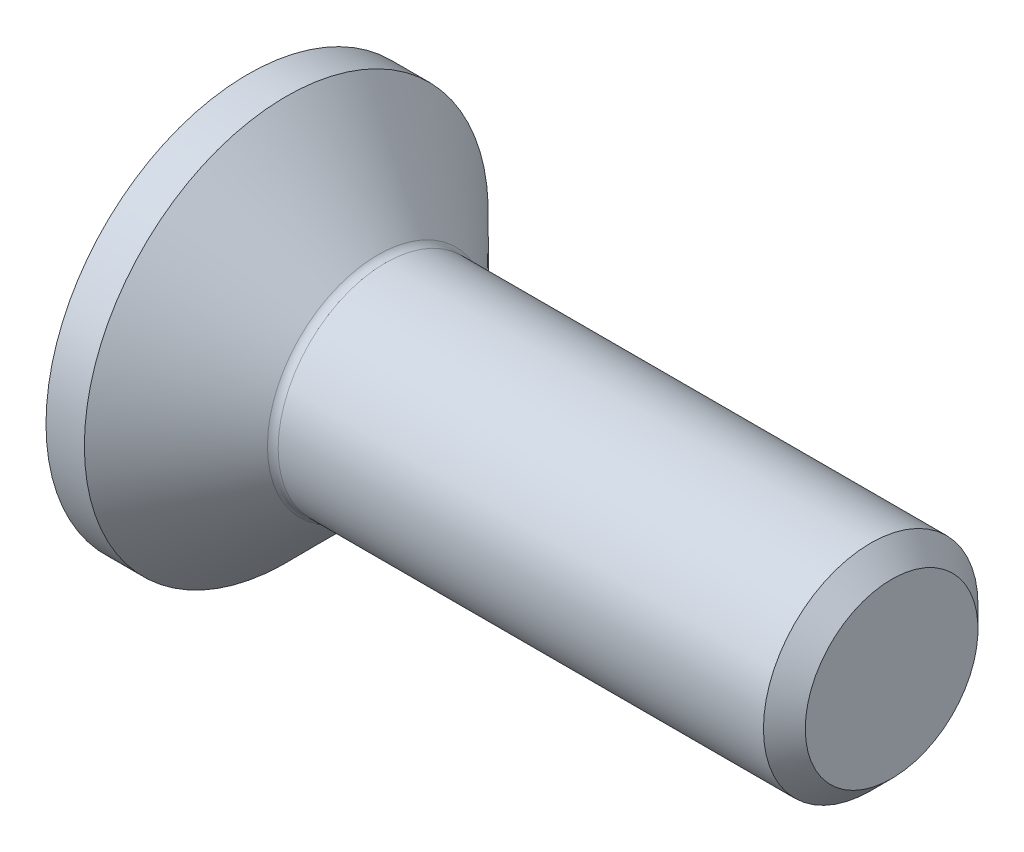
ISO-10303-21;
HEADER;
FILE_DESCRIPTION(('STEP AP214'),'2;1');
FILE_NAME('part.step','',(''),(''),'','','');
FILE_SCHEMA(('AUTOMOTIVE_DESIGN { 1 0 10303 214 1 1 1 1 }'));
ENDSEC;
DATA;
#1=APPLICATION_CONTEXT('core data for automotive mechanical design processes');
#2=APPLICATION_PROTOCOL_DEFINITION('international standard','automotive_design',2000,#1);
#3=PRODUCT_CONTEXT('',#1,'mechanical');
#4=PRODUCT('Part','Part','',(#3));
#5=PRODUCT_RELATED_PRODUCT_CATEGORY('part','',(#4));
#6=PRODUCT_DEFINITION_FORMATION('','',#4);
#7=PRODUCT_DEFINITION_CONTEXT('part definition',#1,'design');
#8=PRODUCT_DEFINITION('design','',#6,#7);
#9=PRODUCT_DEFINITION_SHAPE('','',#8);
#10=(LENGTH_UNIT() NAMED_UNIT(*) SI_UNIT(.MILLI.,.METRE.));
#11=(NAMED_UNIT(*) PLANE_ANGLE_UNIT() SI_UNIT($,.RADIAN.));
#12=(NAMED_UNIT(*) SI_UNIT($,.STERADIAN.) SOLID_ANGLE_UNIT());
#13=UNCERTAINTY_MEASURE_WITH_UNIT(LENGTH_MEASURE(1.E-05),#10,'distance_accuracy_value','');
#14=(GEOMETRIC_REPRESENTATION_CONTEXT(3) GLOBAL_UNCERTAINTY_ASSIGNED_CONTEXT((#13)) GLOBAL_UNIT_ASSIGNED_CONTEXT((#10,
#11,#12)) REPRESENTATION_CONTEXT('',''));
#15=CARTESIAN_POINT('',(0.,0.,0.));
#16=DIRECTION('',(0.,0.,1.));
#17=DIRECTION('',(1.,0.,0.));
#18=AXIS2_PLACEMENT_3D('',#15,#16,#17);
#19=CARTESIAN_POINT('',(0.,0.,0.));
#20=DIRECTION('',(-1.,0.,0.));
#21=DIRECTION('',(0.,0.,1.));
#22=AXIS2_PLACEMENT_3D('',#19,#20,#21);
#23=PLANE('',#22);
#24=CARTESIAN_POINT('',(0.,0.,0.));
#25=DIRECTION('',(-1.,0.,0.));
#26=DIRECTION('',(0.,0.,1.));
#27=AXIS2_PLACEMENT_3D('',#24,#25,#26);
#28=CIRCLE('',#27,3.765);
#29=CARTESIAN_POINT('',(0.,0.,3.765));
#30=VERTEX_POINT('',#29);
#31=EDGE_CURVE('E158',#30,#30,#28,.T.);
#32=ORIENTED_EDGE('',*,*,#31,.T.);
#33=EDGE_LOOP('',(#32));
#34=FACE_BOUND('',#33,.T.);
#35=DIRECTION('',(0.,-0.500000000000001,-0.866025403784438));
#36=VECTOR('',#35,1.);
#37=CARTESIAN_POINT('',(0.,-0.727461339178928,1.26));
#38=LINE('',#37,#36);
#39=CARTESIAN_POINT('',(0.,-0.727461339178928,1.26));
#40=VERTEX_POINT('',#39);
#41=CARTESIAN_POINT('',(0.,-1.45492267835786,0.));
#42=VERTEX_POINT('',#41);
#43=EDGE_CURVE('E120',#40,#42,#38,.T.);
#44=ORIENTED_EDGE('',*,*,#43,.T.);
#45=DIRECTION('',(0.,0.5,-0.866025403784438));
#46=VECTOR('',#45,1.);
#47=CARTESIAN_POINT('',(0.,-1.45492267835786,0.));
#48=LINE('',#47,#46);
#49=CARTESIAN_POINT('',(0.,-0.727461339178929,-1.26));
#50=VERTEX_POINT('',#49);
#51=EDGE_CURVE('E50',#42,#50,#48,.T.);
#52=ORIENTED_EDGE('',*,*,#51,.T.);
#53=DIRECTION('',(0.,1.,0.));
#54=VECTOR('',#53,1.);
#55=CARTESIAN_POINT('',(0.,-0.727461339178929,-1.26));
#56=LINE('',#55,#54);
#57=CARTESIAN_POINT('',(0.,0.727461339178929,-1.26));
#58=VERTEX_POINT('',#57);
#59=EDGE_CURVE('E135',#50,#58,#56,.T.);
#60=ORIENTED_EDGE('',*,*,#59,.T.);
#61=DIRECTION('',(0.,0.5,0.866025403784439));
#62=VECTOR('',#61,1.);
#63=CARTESIAN_POINT('',(0.,0.727461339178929,-1.26));
#64=LINE('',#63,#62);
#65=CARTESIAN_POINT('',(0.,1.45492267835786,0.));
#66=VERTEX_POINT('',#65);
#67=EDGE_CURVE('E271',#58,#66,#64,.T.);
#68=ORIENTED_EDGE('',*,*,#67,.T.);
#69=DIRECTION('',(0.,-0.5,0.866025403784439));
#70=VECTOR('',#69,1.);
#71=CARTESIAN_POINT('',(0.,1.45492267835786,0.));
#72=LINE('',#71,#70);
#73=CARTESIAN_POINT('',(0.,0.727461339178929,1.26));
#74=VERTEX_POINT('',#73);
#75=EDGE_CURVE('E274',#66,#74,#72,.T.);
#76=ORIENTED_EDGE('',*,*,#75,.T.);
#77=DIRECTION('',(0.,-1.,0.));
#78=VECTOR('',#77,1.);
#79=CARTESIAN_POINT('',(0.,0.727461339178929,1.26));
#80=LINE('',#79,#78);
#81=EDGE_CURVE('E277',#74,#40,#80,.T.);
#82=ORIENTED_EDGE('',*,*,#81,.T.);
#83=EDGE_LOOP('',(#44,#52,#60,#68,#76,#82));
#84=FACE_BOUND('',#83,.T.);
#85=ADVANCED_FACE('F35',(#34,#84),#23,.T.);
#86=CARTESIAN_POINT('',(0.,0.,0.));
#87=DIRECTION('',(-1.,0.,0.));
#88=DIRECTION('',(0.,0.,1.));
#89=AXIS2_PLACEMENT_3D('',#86,#87,#88);
#90=CYLINDRICAL_SURFACE('',#89,3.765);
#91=CARTESIAN_POINT('',(0.71500000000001,0.,0.));
#92=DIRECTION('',(-1.,0.,0.));
#93=DIRECTION('',(0.,0.,1.));
#94=AXIS2_PLACEMENT_3D('',#91,#92,#93);
#95=CIRCLE('',#94,3.765);
#96=CARTESIAN_POINT('',(0.71500000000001,0.,3.765));
#97=VERTEX_POINT('',#96);
#98=EDGE_CURVE('E155',#97,#97,#95,.T.);
#99=ORIENTED_EDGE('',*,*,#98,.T.);
#100=EDGE_LOOP('',(#99));
#101=FACE_BOUND('',#100,.T.);
#102=ORIENTED_EDGE('',*,*,#31,.F.);
#103=EDGE_LOOP('',(#102));
#104=FACE_BOUND('',#103,.T.);
#105=ADVANCED_FACE('F179',(#101,#104),#90,.T.);
#106=CARTESIAN_POINT('',(0.71500000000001,0.,0.));
#107=DIRECTION('',(-1.,0.,0.));
#108=DIRECTION('',(0.,0.,1.));
#109=AXIS2_PLACEMENT_3D('',#106,#107,#108);
#110=CONICAL_SURFACE('',#109,3.765,0.785398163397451);
#111=CARTESIAN_POINT('',(2.42142135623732,0.,0.));
#112=DIRECTION('',(-1.,0.,0.));
#113=DIRECTION('',(0.,0.,1.));
#114=AXIS2_PLACEMENT_3D('',#111,#112,#113);
#115=CIRCLE('',#114,2.05857864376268);
#116=CARTESIAN_POINT('',(2.42142135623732,0.,2.05857864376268));
#117=VERTEX_POINT('',#116);
#118=EDGE_CURVE('E43',#117,#117,#115,.T.);
#119=ORIENTED_EDGE('',*,*,#118,.T.);
#120=EDGE_LOOP('',(#119));
#121=FACE_BOUND('',#120,.T.);
#122=ORIENTED_EDGE('',*,*,#98,.F.);
#123=EDGE_LOOP('',(#122));
#124=FACE_BOUND('',#123,.T.);
#125=ADVANCED_FACE('F163',(#121,#124),#110,.T.);
#126=CARTESIAN_POINT('',(0.,0.,0.));
#127=DIRECTION('',(-1.,0.,0.));
#128=DIRECTION('',(0.,0.,1.));
#129=AXIS2_PLACEMENT_3D('',#126,#127,#128);
#130=CYLINDRICAL_SURFACE('',#129,1.99999999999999);
#131=CARTESIAN_POINT('',(2.56284271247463,0.,0.));
#132=DIRECTION('',(-1.,0.,0.));
#133=DIRECTION('',(0.,0.,1.));
#134=AXIS2_PLACEMENT_3D('',#131,#132,#133);
#135=CIRCLE('',#134,1.99999999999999);
#136=CARTESIAN_POINT('',(2.56284271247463,0.,1.99999999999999));
#137=VERTEX_POINT('',#136);
#138=EDGE_CURVE('E11',#137,#137,#135,.F.);
#139=ORIENTED_EDGE('',*,*,#138,.T.);
#140=EDGE_LOOP('',(#139));
#141=FACE_BOUND('',#140,.T.);
#142=CARTESIAN_POINT('',(11.61,0.,0.));
#143=DIRECTION('',(-1.,0.,0.));
#144=DIRECTION('',(0.,0.,1.));
#145=AXIS2_PLACEMENT_3D('',#142,#143,#144);
#146=CIRCLE('',#145,1.99999999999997);
#147=CARTESIAN_POINT('',(11.61,0.,1.99999999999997));
#148=VERTEX_POINT('',#147);
#149=EDGE_CURVE('E152',#148,#148,#146,.T.);
#150=ORIENTED_EDGE('',*,*,#149,.T.);
#151=EDGE_LOOP('',(#150));
#152=FACE_BOUND('',#151,.T.);
#153=ADVANCED_FACE('F190',(#141,#152),#130,.T.);
#154=CARTESIAN_POINT('',(12.,0.,0.));
#155=DIRECTION('',(-1.,0.,0.));
#156=DIRECTION('',(0.,0.,1.));
#157=AXIS2_PLACEMENT_3D('',#154,#155,#156);
#158=CONICAL_SURFACE('',#157,1.61,0.785398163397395);
#159=ORIENTED_EDGE('',*,*,#149,.F.);
#160=EDGE_LOOP('',(#159));
#161=FACE_BOUND('',#160,.T.);
#162=CARTESIAN_POINT('',(12.,0.,0.));
#163=DIRECTION('',(-1.,0.,0.));
#164=DIRECTION('',(0.,0.,1.));
#165=AXIS2_PLACEMENT_3D('',#162,#163,#164);
#166=CIRCLE('',#165,1.61);
#167=CARTESIAN_POINT('',(12.,0.,1.61));
#168=VERTEX_POINT('',#167);
#169=EDGE_CURVE('E148',#168,#168,#166,.T.);
#170=ORIENTED_EDGE('',*,*,#169,.T.);
#171=EDGE_LOOP('',(#170));
#172=FACE_BOUND('',#171,.T.);
#173=ADVANCED_FACE('F174',(#161,#172),#158,.T.);
#174=CARTESIAN_POINT('',(12.,1.61,0.));
#175=DIRECTION('',(1.,0.,0.));
#176=DIRECTION('',(0.,0.,-1.));
#177=AXIS2_PLACEMENT_3D('',#174,#175,#176);
#178=PLANE('',#177);
#179=ORIENTED_EDGE('',*,*,#169,.F.);
#180=EDGE_LOOP('',(#179));
#181=FACE_BOUND('',#180,.T.);
#182=ADVANCED_FACE('F167',(#181),#178,.T.);
#183=CARTESIAN_POINT('',(2.56284271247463,0.,0.));
#184=DIRECTION('',(-1.,0.,0.));
#185=DIRECTION('',(0.,0.,1.));
#186=AXIS2_PLACEMENT_3D('',#183,#184,#185);
#187=TOROIDAL_SURFACE('',#186,2.19999999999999,0.2);
#188=ORIENTED_EDGE('',*,*,#138,.F.);
#189=EDGE_LOOP('',(#188));
#190=FACE_BOUND('',#189,.T.);
#191=ORIENTED_EDGE('',*,*,#118,.F.);
#192=EDGE_LOOP('',(#191));
#193=FACE_BOUND('',#192,.T.);
#194=ADVANCED_FACE('F37',(#190,#193),#187,.F.);
#195=CARTESIAN_POINT('',(1.5,-1.45492267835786,0.));
#196=DIRECTION('',(0.,0.866025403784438,0.5));
#197=DIRECTION('',(0.,-0.5,0.866025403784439));
#198=AXIS2_PLACEMENT_3D('',#195,#196,#197);
#199=PLANE('',#198);
#200=ORIENTED_EDGE('',*,*,#51,.F.);
#201=DIRECTION('',(-1.,0.,0.));
#202=VECTOR('',#201,1.);
#203=CARTESIAN_POINT('',(1.5,-1.45492267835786,0.));
#204=LINE('',#203,#202);
#205=CARTESIAN_POINT('',(1.5,-1.45492267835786,0.));
#206=VERTEX_POINT('',#205);
#207=EDGE_CURVE('E268',#206,#42,#204,.T.);
#208=ORIENTED_EDGE('',*,*,#207,.F.);
#209=DIRECTION('',(0.,0.5,-0.866025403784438));
#210=VECTOR('',#209,1.);
#211=CARTESIAN_POINT('',(1.5,-1.45492267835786,0.));
#212=LINE('',#211,#210);
#213=CARTESIAN_POINT('',(1.5,-1.09119200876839,-0.630000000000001));
#214=VERTEX_POINT('',#213);
#215=EDGE_CURVE('E117',#206,#214,#212,.T.);
#216=ORIENTED_EDGE('',*,*,#215,.T.);
#217=CARTESIAN_POINT('',(1.5,-0.727461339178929,-1.26));
#218=VERTEX_POINT('',#217);
#219=EDGE_CURVE('E111',#214,#218,#212,.T.);
#220=ORIENTED_EDGE('',*,*,#219,.T.);
#221=DIRECTION('',(-1.,0.,0.));
#222=VECTOR('',#221,1.);
#223=CARTESIAN_POINT('',(1.5,-0.727461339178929,-1.26));
#224=LINE('',#223,#222);
#225=EDGE_CURVE('E115',#218,#50,#224,.T.);
#226=ORIENTED_EDGE('',*,*,#225,.T.);
#227=EDGE_LOOP('',(#200,#208,#216,#220,#226));
#228=FACE_BOUND('',#227,.T.);
#229=ADVANCED_FACE('F113',(#228),#199,.T.);
#230=CARTESIAN_POINT('',(1.5,-0.727461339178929,-1.26));
#231=DIRECTION('',(0.,0.,1.));
#232=DIRECTION('',(0.,-1.,0.));
#233=AXIS2_PLACEMENT_3D('',#230,#231,#232);
#234=PLANE('',#233);
#235=ORIENTED_EDGE('',*,*,#59,.F.);
#236=ORIENTED_EDGE('',*,*,#225,.F.);
#237=DIRECTION('',(0.,1.,0.));
#238=VECTOR('',#237,1.);
#239=CARTESIAN_POINT('',(1.5,-0.727461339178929,-1.26));
#240=LINE('',#239,#238);
#241=CARTESIAN_POINT('',(1.5,0.,-1.26));
#242=VERTEX_POINT('',#241);
#243=EDGE_CURVE('E123',#218,#242,#240,.T.);
#244=ORIENTED_EDGE('',*,*,#243,.T.);
#245=CARTESIAN_POINT('',(1.5,0.727461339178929,-1.26));
#246=VERTEX_POINT('',#245);
#247=EDGE_CURVE('E130',#242,#246,#240,.T.);
#248=ORIENTED_EDGE('',*,*,#247,.T.);
#249=DIRECTION('',(-1.,0.,0.));
#250=VECTOR('',#249,1.);
#251=CARTESIAN_POINT('',(1.5,0.727461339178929,-1.26));
#252=LINE('',#251,#250);
#253=EDGE_CURVE('E137',#246,#58,#252,.T.);
#254=ORIENTED_EDGE('',*,*,#253,.T.);
#255=EDGE_LOOP('',(#235,#236,#244,#248,#254));
#256=FACE_BOUND('',#255,.T.);
#257=ADVANCED_FACE('F132',(#256),#234,.T.);
#258=CARTESIAN_POINT('',(1.5,0.727461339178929,-1.26));
#259=DIRECTION('',(0.,-0.866025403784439,0.499999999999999));
#260=DIRECTION('',(0.,-0.5,-0.866025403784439));
#261=AXIS2_PLACEMENT_3D('',#258,#259,#260);
#262=PLANE('',#261);
#263=ORIENTED_EDGE('',*,*,#67,.F.);
#264=ORIENTED_EDGE('',*,*,#253,.F.);
#265=DIRECTION('',(0.,0.5,0.866025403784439));
#266=VECTOR('',#265,1.);
#267=CARTESIAN_POINT('',(1.5,0.727461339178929,-1.26));
#268=LINE('',#267,#266);
#269=CARTESIAN_POINT('',(1.5,1.09119200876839,-0.629999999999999));
#270=VERTEX_POINT('',#269);
#271=EDGE_CURVE('E260',#246,#270,#268,.T.);
#272=ORIENTED_EDGE('',*,*,#271,.T.);
#273=CARTESIAN_POINT('',(1.5,1.45492267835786,0.));
#274=VERTEX_POINT('',#273);
#275=EDGE_CURVE('E129',#270,#274,#268,.T.);
#276=ORIENTED_EDGE('',*,*,#275,.T.);
#277=DIRECTION('',(-1.,0.,0.));
#278=VECTOR('',#277,1.);
#279=CARTESIAN_POINT('',(1.5,1.45492267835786,0.));
#280=LINE('',#279,#278);
#281=EDGE_CURVE('E143',#274,#66,#280,.T.);
#282=ORIENTED_EDGE('',*,*,#281,.T.);
#283=EDGE_LOOP('',(#263,#264,#272,#276,#282));
#284=FACE_BOUND('',#283,.T.);
#285=ADVANCED_FACE('F204',(#284),#262,.T.);
#286=CARTESIAN_POINT('',(1.5,1.45492267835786,0.));
#287=DIRECTION('',(0.,-0.866025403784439,-0.5));
#288=DIRECTION('',(0.,0.5,-0.866025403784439));
#289=AXIS2_PLACEMENT_3D('',#286,#287,#288);
#290=PLANE('',#289);
#291=ORIENTED_EDGE('',*,*,#75,.F.);
#292=ORIENTED_EDGE('',*,*,#281,.F.);
#293=DIRECTION('',(0.,-0.5,0.866025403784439));
#294=VECTOR('',#293,1.);
#295=CARTESIAN_POINT('',(1.5,1.45492267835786,0.));
#296=LINE('',#295,#294);
#297=CARTESIAN_POINT('',(1.5,1.09119200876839,0.63));
#298=VERTEX_POINT('',#297);
#299=EDGE_CURVE('E58',#274,#298,#296,.T.);
#300=ORIENTED_EDGE('',*,*,#299,.T.);
#301=CARTESIAN_POINT('',(1.5,0.727461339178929,1.26));
#302=VERTEX_POINT('',#301);
#303=EDGE_CURVE('E239',#298,#302,#296,.T.);
#304=ORIENTED_EDGE('',*,*,#303,.T.);
#305=DIRECTION('',(-1.,0.,0.));
#306=VECTOR('',#305,1.);
#307=CARTESIAN_POINT('',(1.5,0.727461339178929,1.26));
#308=LINE('',#307,#306);
#309=EDGE_CURVE('E253',#302,#74,#308,.T.);
#310=ORIENTED_EDGE('',*,*,#309,.T.);
#311=EDGE_LOOP('',(#291,#292,#300,#304,#310));
#312=FACE_BOUND('',#311,.T.);
#313=ADVANCED_FACE('F207',(#312),#290,.T.);
#314=CARTESIAN_POINT('',(1.5,0.727461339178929,1.26));
#315=DIRECTION('',(0.,0.,-1.));
#316=DIRECTION('',(-1.,0.,0.));
#317=AXIS2_PLACEMENT_3D('',#314,#315,#316);
#318=PLANE('',#317);
#319=ORIENTED_EDGE('',*,*,#81,.F.);
#320=ORIENTED_EDGE('',*,*,#309,.F.);
#321=DIRECTION('',(0.,-1.,0.));
#322=VECTOR('',#321,1.);
#323=CARTESIAN_POINT('',(1.5,0.727461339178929,1.26));
#324=LINE('',#323,#322);
#325=CARTESIAN_POINT('',(1.5,0.,1.26));
#326=VERTEX_POINT('',#325);
#327=EDGE_CURVE('E238',#302,#326,#324,.T.);
#328=ORIENTED_EDGE('',*,*,#327,.T.);
#329=CARTESIAN_POINT('',(1.5,-0.727461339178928,1.26));
#330=VERTEX_POINT('',#329);
#331=EDGE_CURVE('E244',#326,#330,#324,.T.);
#332=ORIENTED_EDGE('',*,*,#331,.T.);
#333=DIRECTION('',(-1.,0.,0.));
#334=VECTOR('',#333,1.);
#335=CARTESIAN_POINT('',(1.5,-0.727461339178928,1.26));
#336=LINE('',#335,#334);
#337=EDGE_CURVE('E283',#330,#40,#336,.T.);
#338=ORIENTED_EDGE('',*,*,#337,.T.);
#339=EDGE_LOOP('',(#319,#320,#328,#332,#338));
#340=FACE_BOUND('',#339,.T.);
#341=ADVANCED_FACE('F211',(#340),#318,.T.);
#342=CARTESIAN_POINT('',(1.5,-0.727461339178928,1.26));
#343=DIRECTION('',(0.,0.866025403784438,-0.500000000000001));
#344=DIRECTION('',(0.,0.500000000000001,0.866025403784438));
#345=AXIS2_PLACEMENT_3D('',#342,#343,#344);
#346=PLANE('',#345);
#347=ORIENTED_EDGE('',*,*,#43,.F.);
#348=ORIENTED_EDGE('',*,*,#337,.F.);
#349=DIRECTION('',(0.,-0.500000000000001,-0.866025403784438));
#350=VECTOR('',#349,1.);
#351=CARTESIAN_POINT('',(1.5,-0.727461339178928,1.26));
#352=LINE('',#351,#350);
#353=CARTESIAN_POINT('',(1.5,-1.09119200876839,0.630000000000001));
#354=VERTEX_POINT('',#353);
#355=EDGE_CURVE('E247',#330,#354,#352,.T.);
#356=ORIENTED_EDGE('',*,*,#355,.T.);
#357=EDGE_CURVE('E254',#354,#206,#352,.T.);
#358=ORIENTED_EDGE('',*,*,#357,.T.);
#359=ORIENTED_EDGE('',*,*,#207,.T.);
#360=EDGE_LOOP('',(#347,#348,#356,#358,#359));
#361=FACE_BOUND('',#360,.T.);
#362=ADVANCED_FACE('F214',(#361),#346,.T.);
#363=CARTESIAN_POINT('',(1.5,-1.45492267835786,0.));
#364=DIRECTION('',(-1.,0.,0.));
#365=DIRECTION('',(0.,0.,1.));
#366=AXIS2_PLACEMENT_3D('',#363,#364,#365);
#367=PLANE('',#366);
#368=CARTESIAN_POINT('',(1.5,0.,0.));
#369=DIRECTION('',(-1.,0.,0.));
#370=DIRECTION('',(0.,0.,1.));
#371=AXIS2_PLACEMENT_3D('',#368,#369,#370);
#372=CIRCLE('',#371,1.26);
#373=EDGE_CURVE('E136',#354,#326,#372,.T.);
#374=ORIENTED_EDGE('',*,*,#373,.F.);
#375=ORIENTED_EDGE('',*,*,#355,.F.);
#376=ORIENTED_EDGE('',*,*,#331,.F.);
#377=EDGE_LOOP('',(#374,#375,#376));
#378=FACE_BOUND('',#377,.T.);
#379=ADVANCED_FACE('F218',(#378),#367,.T.);
#380=EDGE_CURVE('E140',#214,#354,#372,.T.);
#381=ORIENTED_EDGE('',*,*,#380,.F.);
#382=ORIENTED_EDGE('',*,*,#215,.F.);
#383=ORIENTED_EDGE('',*,*,#357,.F.);
#384=EDGE_LOOP('',(#381,#382,#383));
#385=FACE_BOUND('',#384,.T.);
#386=ADVANCED_FACE('F221',(#385),#367,.T.);
#387=EDGE_CURVE('E125',#242,#214,#372,.T.);
#388=ORIENTED_EDGE('',*,*,#387,.F.);
#389=ORIENTED_EDGE('',*,*,#243,.F.);
#390=ORIENTED_EDGE('',*,*,#219,.F.);
#391=EDGE_LOOP('',(#388,#389,#390));
#392=FACE_BOUND('',#391,.T.);
#393=ADVANCED_FACE('F124',(#392),#367,.T.);
#394=EDGE_CURVE('E256',#270,#242,#372,.T.);
#395=ORIENTED_EDGE('',*,*,#394,.F.);
#396=ORIENTED_EDGE('',*,*,#271,.F.);
#397=ORIENTED_EDGE('',*,*,#247,.F.);
#398=EDGE_LOOP('',(#395,#396,#397));
#399=FACE_BOUND('',#398,.T.);
#400=ADVANCED_FACE('F233',(#399),#367,.T.);
#401=EDGE_CURVE('E149',#298,#270,#372,.T.);
#402=ORIENTED_EDGE('',*,*,#401,.F.);
#403=ORIENTED_EDGE('',*,*,#299,.F.);
#404=ORIENTED_EDGE('',*,*,#275,.F.);
#405=EDGE_LOOP('',(#402,#403,#404));
#406=FACE_BOUND('',#405,.T.);
#407=ADVANCED_FACE('F228',(#406),#367,.T.);
#408=EDGE_CURVE('E142',#326,#298,#372,.T.);
#409=ORIENTED_EDGE('',*,*,#408,.F.);
#410=ORIENTED_EDGE('',*,*,#327,.F.);
#411=ORIENTED_EDGE('',*,*,#303,.F.);
#412=EDGE_LOOP('',(#409,#410,#411));
#413=FACE_BOUND('',#412,.T.);
#414=ADVANCED_FACE('F199',(#413),#367,.T.);
#415=CARTESIAN_POINT('',(1.5,0.,0.));
#416=DIRECTION('',(-1.,0.,0.));
#417=DIRECTION('',(0.,0.,1.));
#418=AXIS2_PLACEMENT_3D('',#415,#416,#417);
#419=CONICAL_SURFACE('',#418,1.26,1.04719755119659);
#420=CARTESIAN_POINT('',(2.22746133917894,0.,0.));
#421=VERTEX_POINT('',#420);
#422=VERTEX_LOOP('',#421);
#423=FACE_BOUND('',#422,.T.);
#424=ORIENTED_EDGE('',*,*,#408,.T.);
#425=ORIENTED_EDGE('',*,*,#401,.T.);
#426=ORIENTED_EDGE('',*,*,#394,.T.);
#427=ORIENTED_EDGE('',*,*,#387,.T.);
#428=ORIENTED_EDGE('',*,*,#380,.T.);
#429=ORIENTED_EDGE('',*,*,#373,.T.);
#430=EDGE_LOOP('',(#424,#425,#426,#427,#428,#429));
#431=FACE_BOUND('',#430,.T.);
#432=ADVANCED_FACE('F197',(#423,#431),#419,.F.);
#433=CLOSED_SHELL('',(#85,#105,#125,#153,#173,#182,#194,#229,#257,#285,#313,#341,#362,#379,#386,
#393,#400,#407,#414,#432));
#434=MANIFOLD_SOLID_BREP('B2',#433);
#435=ADVANCED_BREP_SHAPE_REPRESENTATION('',(#18,#434),#14);
#436=SHAPE_DEFINITION_REPRESENTATION(#9,#435);
ENDSEC;
END-ISO-10303-21;
